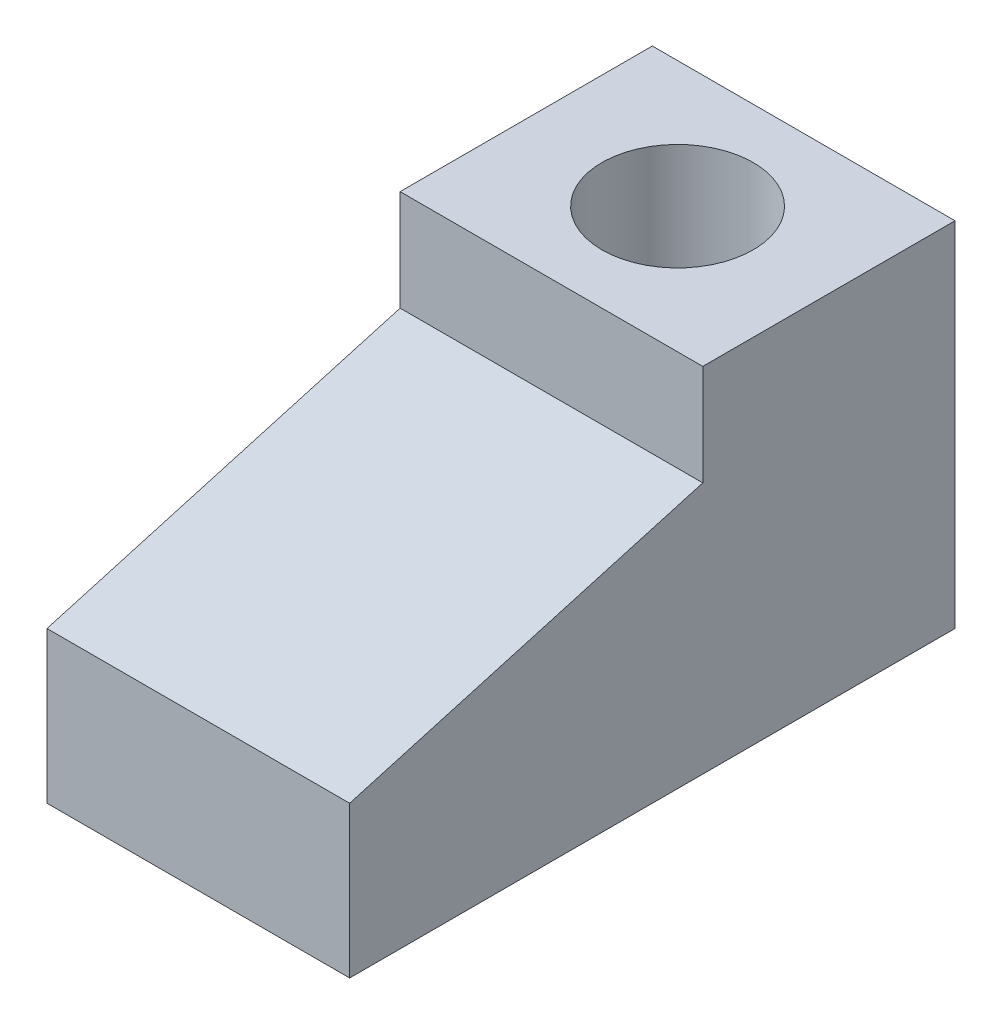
ISO-10303-21;
HEADER;
FILE_DESCRIPTION(('STEP AP214'),'2;1');
FILE_NAME('part.step','',(''),(''),'','','');
FILE_SCHEMA(('AUTOMOTIVE_DESIGN { 1 0 10303 214 1 1 1 1 }'));
ENDSEC;
DATA;
#1=APPLICATION_CONTEXT('core data for automotive mechanical design processes');
#2=APPLICATION_PROTOCOL_DEFINITION('international standard','automotive_design',2000,#1);
#3=PRODUCT_CONTEXT('',#1,'mechanical');
#4=PRODUCT('Part','Part','',(#3));
#5=PRODUCT_RELATED_PRODUCT_CATEGORY('part','',(#4));
#6=PRODUCT_DEFINITION_FORMATION('','',#4);
#7=PRODUCT_DEFINITION_CONTEXT('part definition',#1,'design');
#8=PRODUCT_DEFINITION('design','',#6,#7);
#9=PRODUCT_DEFINITION_SHAPE('','',#8);
#10=(LENGTH_UNIT() NAMED_UNIT(*) SI_UNIT(.MILLI.,.METRE.));
#11=(NAMED_UNIT(*) PLANE_ANGLE_UNIT() SI_UNIT($,.RADIAN.));
#12=(NAMED_UNIT(*) SI_UNIT($,.STERADIAN.) SOLID_ANGLE_UNIT());
#13=UNCERTAINTY_MEASURE_WITH_UNIT(LENGTH_MEASURE(1.E-05),#10,'distance_accuracy_value','');
#14=(GEOMETRIC_REPRESENTATION_CONTEXT(3) GLOBAL_UNCERTAINTY_ASSIGNED_CONTEXT((#13)) GLOBAL_UNIT_ASSIGNED_CONTEXT((#10,
#11,#12)) REPRESENTATION_CONTEXT('',''));
#15=CARTESIAN_POINT('',(0.,0.,0.));
#16=DIRECTION('',(0.,0.,1.));
#17=DIRECTION('',(1.,0.,0.));
#18=AXIS2_PLACEMENT_3D('',#15,#16,#17);
#19=CARTESIAN_POINT('',(10.,6.,2.));
#20=DIRECTION('',(0.,0.,-1.));
#21=DIRECTION('',(0.,1.,0.));
#22=AXIS2_PLACEMENT_3D('',#19,#20,#21);
#23=PLANE('',#22);
#24=DIRECTION('',(0.,-1.,0.));
#25=VECTOR('',#24,1.);
#26=CARTESIAN_POINT('',(4.,6.,2.));
#27=LINE('',#26,#25);
#28=CARTESIAN_POINT('',(4.,6.,2.));
#29=VERTEX_POINT('',#28);
#30=CARTESIAN_POINT('',(4.,3.,2.));
#31=VERTEX_POINT('',#30);
#32=EDGE_CURVE('E86',#29,#31,#27,.T.);
#33=ORIENTED_EDGE('',*,*,#32,.T.);
#34=DIRECTION('',(-1.,0.,0.));
#35=VECTOR('',#34,1.);
#36=CARTESIAN_POINT('',(10.,3.,2.));
#37=LINE('',#36,#35);
#38=CARTESIAN_POINT('',(10.,3.,2.));
#39=VERTEX_POINT('',#38);
#40=EDGE_CURVE('E11',#39,#31,#37,.T.);
#41=ORIENTED_EDGE('',*,*,#40,.F.);
#42=DIRECTION('',(0.,-1.,0.));
#43=VECTOR('',#42,1.);
#44=CARTESIAN_POINT('',(10.,6.,2.));
#45=LINE('',#44,#43);
#46=CARTESIAN_POINT('',(10.,6.,2.));
#47=VERTEX_POINT('',#46);
#48=EDGE_CURVE('E114',#47,#39,#45,.T.);
#49=ORIENTED_EDGE('',*,*,#48,.F.);
#50=DIRECTION('',(-1.,0.,0.));
#51=VECTOR('',#50,1.);
#52=CARTESIAN_POINT('',(10.,6.,2.));
#53=LINE('',#52,#51);
#54=EDGE_CURVE('E99',#47,#29,#53,.T.);
#55=ORIENTED_EDGE('',*,*,#54,.T.);
#56=EDGE_LOOP('',(#33,#41,#49,#55));
#57=FACE_BOUND('',#56,.T.);
#58=ADVANCED_FACE('F30',(#57),#23,.F.);
#59=CARTESIAN_POINT('',(10.,3.,2.));
#60=DIRECTION('',(0.,1.,0.));
#61=DIRECTION('',(0.,0.,1.));
#62=AXIS2_PLACEMENT_3D('',#59,#60,#61);
#63=PLANE('',#62);
#64=CARTESIAN_POINT('',(7.,3.,-7.50000000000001));
#65=DIRECTION('',(0.,1.,0.));
#66=DIRECTION('',(0.,0.,1.));
#67=AXIS2_PLACEMENT_3D('',#64,#65,#66);
#68=CIRCLE('',#67,1.5);
#69=CARTESIAN_POINT('',(7.,3.,-6.00000000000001));
#70=VERTEX_POINT('',#69);
#71=EDGE_CURVE('E100',#70,#70,#68,.T.);
#72=ORIENTED_EDGE('',*,*,#71,.T.);
#73=EDGE_LOOP('',(#72));
#74=FACE_BOUND('',#73,.T.);
#75=DIRECTION('',(0.,0.,-1.));
#76=VECTOR('',#75,1.);
#77=CARTESIAN_POINT('',(4.,3.,2.));
#78=LINE('',#77,#76);
#79=CARTESIAN_POINT('',(4.,3.,-10.));
#80=VERTEX_POINT('',#79);
#81=EDGE_CURVE('E82',#31,#80,#78,.T.);
#82=ORIENTED_EDGE('',*,*,#81,.T.);
#83=DIRECTION('',(-1.,0.,0.));
#84=VECTOR('',#83,1.);
#85=CARTESIAN_POINT('',(10.,3.,-10.));
#86=LINE('',#85,#84);
#87=CARTESIAN_POINT('',(10.,3.,-10.));
#88=VERTEX_POINT('',#87);
#89=EDGE_CURVE('E37',#88,#80,#86,.T.);
#90=ORIENTED_EDGE('',*,*,#89,.F.);
#91=DIRECTION('',(0.,0.,-1.));
#92=VECTOR('',#91,1.);
#93=CARTESIAN_POINT('',(10.,3.,2.));
#94=LINE('',#93,#92);
#95=EDGE_CURVE('E95',#39,#88,#94,.T.);
#96=ORIENTED_EDGE('',*,*,#95,.F.);
#97=ORIENTED_EDGE('',*,*,#40,.T.);
#98=EDGE_LOOP('',(#82,#90,#96,#97));
#99=FACE_BOUND('',#98,.T.);
#100=ADVANCED_FACE('F94',(#74,#99),#63,.F.);
#101=CARTESIAN_POINT('',(10.,3.,-10.));
#102=DIRECTION('',(0.,0.,1.));
#103=DIRECTION('',(0.,-1.,0.));
#104=AXIS2_PLACEMENT_3D('',#101,#102,#103);
#105=PLANE('',#104);
#106=DIRECTION('',(0.,1.,0.));
#107=VECTOR('',#106,1.);
#108=CARTESIAN_POINT('',(4.,3.,-10.));
#109=LINE('',#108,#107);
#110=CARTESIAN_POINT('',(4.,10.,-10.));
#111=VERTEX_POINT('',#110);
#112=EDGE_CURVE('E88',#80,#111,#109,.T.);
#113=ORIENTED_EDGE('',*,*,#112,.T.);
#114=DIRECTION('',(-1.,0.,0.));
#115=VECTOR('',#114,1.);
#116=CARTESIAN_POINT('',(10.,10.,-10.));
#117=LINE('',#116,#115);
#118=CARTESIAN_POINT('',(10.,10.,-10.));
#119=VERTEX_POINT('',#118);
#120=EDGE_CURVE('E130',#119,#111,#117,.T.);
#121=ORIENTED_EDGE('',*,*,#120,.F.);
#122=DIRECTION('',(0.,1.,0.));
#123=VECTOR('',#122,1.);
#124=CARTESIAN_POINT('',(10.,3.,-10.));
#125=LINE('',#124,#123);
#126=EDGE_CURVE('E117',#88,#119,#125,.T.);
#127=ORIENTED_EDGE('',*,*,#126,.F.);
#128=ORIENTED_EDGE('',*,*,#89,.T.);
#129=EDGE_LOOP('',(#113,#121,#127,#128));
#130=FACE_BOUND('',#129,.T.);
#131=ADVANCED_FACE('F134',(#130),#105,.F.);
#132=CARTESIAN_POINT('',(10.,10.,-10.));
#133=DIRECTION('',(0.,-1.,0.));
#134=DIRECTION('',(0.,0.,-1.));
#135=AXIS2_PLACEMENT_3D('',#132,#133,#134);
#136=PLANE('',#135);
#137=CARTESIAN_POINT('',(7.,10.,-7.5));
#138=DIRECTION('',(0.,1.,0.));
#139=DIRECTION('',(0.,0.,1.));
#140=AXIS2_PLACEMENT_3D('',#137,#138,#139);
#141=CIRCLE('',#140,1.5);
#142=CARTESIAN_POINT('',(7.,10.,-6.));
#143=VERTEX_POINT('',#142);
#144=EDGE_CURVE('E103',#143,#143,#141,.T.);
#145=ORIENTED_EDGE('',*,*,#144,.F.);
#146=EDGE_LOOP('',(#145));
#147=FACE_BOUND('',#146,.T.);
#148=DIRECTION('',(0.,0.,1.));
#149=VECTOR('',#148,1.);
#150=CARTESIAN_POINT('',(4.,10.,-10.));
#151=LINE('',#150,#149);
#152=CARTESIAN_POINT('',(4.,10.,-5.));
#153=VERTEX_POINT('',#152);
#154=EDGE_CURVE('E108',#111,#153,#151,.T.);
#155=ORIENTED_EDGE('',*,*,#154,.T.);
#156=DIRECTION('',(-1.,0.,0.));
#157=VECTOR('',#156,1.);
#158=CARTESIAN_POINT('',(10.,10.,-5.));
#159=LINE('',#158,#157);
#160=CARTESIAN_POINT('',(10.,10.,-5.));
#161=VERTEX_POINT('',#160);
#162=EDGE_CURVE('E127',#161,#153,#159,.T.);
#163=ORIENTED_EDGE('',*,*,#162,.F.);
#164=DIRECTION('',(0.,0.,1.));
#165=VECTOR('',#164,1.);
#166=CARTESIAN_POINT('',(10.,10.,-10.));
#167=LINE('',#166,#165);
#168=EDGE_CURVE('E119',#119,#161,#167,.T.);
#169=ORIENTED_EDGE('',*,*,#168,.F.);
#170=ORIENTED_EDGE('',*,*,#120,.T.);
#171=EDGE_LOOP('',(#155,#163,#169,#170));
#172=FACE_BOUND('',#171,.T.);
#173=ADVANCED_FACE('F140',(#147,#172),#136,.F.);
#174=CARTESIAN_POINT('',(10.,10.,-5.));
#175=DIRECTION('',(0.,0.,-1.));
#176=DIRECTION('',(0.,1.,0.));
#177=AXIS2_PLACEMENT_3D('',#174,#175,#176);
#178=PLANE('',#177);
#179=DIRECTION('',(0.,-1.,0.));
#180=VECTOR('',#179,1.);
#181=CARTESIAN_POINT('',(4.,10.,-5.));
#182=LINE('',#181,#180);
#183=CARTESIAN_POINT('',(4.,8.,-5.));
#184=VERTEX_POINT('',#183);
#185=EDGE_CURVE('E110',#153,#184,#182,.T.);
#186=ORIENTED_EDGE('',*,*,#185,.T.);
#187=DIRECTION('',(-1.,0.,0.));
#188=VECTOR('',#187,1.);
#189=CARTESIAN_POINT('',(10.,8.,-5.));
#190=LINE('',#189,#188);
#191=CARTESIAN_POINT('',(10.,8.,-5.));
#192=VERTEX_POINT('',#191);
#193=EDGE_CURVE('E124',#192,#184,#190,.T.);
#194=ORIENTED_EDGE('',*,*,#193,.F.);
#195=DIRECTION('',(0.,-1.,0.));
#196=VECTOR('',#195,1.);
#197=CARTESIAN_POINT('',(10.,10.,-5.));
#198=LINE('',#197,#196);
#199=EDGE_CURVE('E49',#161,#192,#198,.T.);
#200=ORIENTED_EDGE('',*,*,#199,.F.);
#201=ORIENTED_EDGE('',*,*,#162,.T.);
#202=EDGE_LOOP('',(#186,#194,#200,#201));
#203=FACE_BOUND('',#202,.T.);
#204=ADVANCED_FACE('F143',(#203),#178,.F.);
#205=CARTESIAN_POINT('',(10.,8.,-5.));
#206=DIRECTION('',(0.,-0.961523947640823,-0.274721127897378));
#207=DIRECTION('',(0.,0.274721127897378,-0.961523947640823));
#208=AXIS2_PLACEMENT_3D('',#205,#206,#207);
#209=PLANE('',#208);
#210=DIRECTION('',(0.,-0.274721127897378,0.961523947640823));
#211=VECTOR('',#210,1.);
#212=CARTESIAN_POINT('',(4.,8.,-5.));
#213=LINE('',#212,#211);
#214=EDGE_CURVE('E112',#184,#29,#213,.T.);
#215=ORIENTED_EDGE('',*,*,#214,.T.);
#216=ORIENTED_EDGE('',*,*,#54,.F.);
#217=DIRECTION('',(0.,-0.274721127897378,0.961523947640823));
#218=VECTOR('',#217,1.);
#219=CARTESIAN_POINT('',(10.,8.,-5.));
#220=LINE('',#219,#218);
#221=EDGE_CURVE('E44',#192,#47,#220,.T.);
#222=ORIENTED_EDGE('',*,*,#221,.F.);
#223=ORIENTED_EDGE('',*,*,#193,.T.);
#224=EDGE_LOOP('',(#215,#216,#222,#223));
#225=FACE_BOUND('',#224,.T.);
#226=ADVANCED_FACE('F145',(#225),#209,.F.);
#227=CARTESIAN_POINT('',(10.,3.,2.));
#228=DIRECTION('',(1.,0.,0.));
#229=DIRECTION('',(0.,0.,-1.));
#230=AXIS2_PLACEMENT_3D('',#227,#228,#229);
#231=PLANE('',#230);
#232=ORIENTED_EDGE('',*,*,#48,.T.);
#233=ORIENTED_EDGE('',*,*,#95,.T.);
#234=ORIENTED_EDGE('',*,*,#126,.T.);
#235=ORIENTED_EDGE('',*,*,#168,.T.);
#236=ORIENTED_EDGE('',*,*,#199,.T.);
#237=ORIENTED_EDGE('',*,*,#221,.T.);
#238=EDGE_LOOP('',(#232,#233,#234,#235,#236,#237));
#239=FACE_BOUND('',#238,.T.);
#240=ADVANCED_FACE('F137',(#239),#231,.T.);
#241=CARTESIAN_POINT('',(4.,3.,2.));
#242=DIRECTION('',(1.,0.,0.));
#243=DIRECTION('',(0.,0.,-1.));
#244=AXIS2_PLACEMENT_3D('',#241,#242,#243);
#245=PLANE('',#244);
#246=ORIENTED_EDGE('',*,*,#32,.F.);
#247=ORIENTED_EDGE('',*,*,#214,.F.);
#248=ORIENTED_EDGE('',*,*,#185,.F.);
#249=ORIENTED_EDGE('',*,*,#154,.F.);
#250=ORIENTED_EDGE('',*,*,#112,.F.);
#251=ORIENTED_EDGE('',*,*,#81,.F.);
#252=EDGE_LOOP('',(#246,#247,#248,#249,#250,#251));
#253=FACE_BOUND('',#252,.T.);
#254=ADVANCED_FACE('F83',(#253),#245,.F.);
#255=CARTESIAN_POINT('',(7.,3.,-7.50000000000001));
#256=DIRECTION('',(0.,1.,0.));
#257=DIRECTION('',(0.,0.,1.));
#258=AXIS2_PLACEMENT_3D('',#255,#256,#257);
#259=CYLINDRICAL_SURFACE('',#258,1.5);
#260=ORIENTED_EDGE('',*,*,#71,.F.);
#261=EDGE_LOOP('',(#260));
#262=FACE_BOUND('',#261,.T.);
#263=ORIENTED_EDGE('',*,*,#144,.T.);
#264=EDGE_LOOP('',(#263));
#265=FACE_BOUND('',#264,.T.);
#266=ADVANCED_FACE('F171',(#262,#265),#259,.F.);
#267=CLOSED_SHELL('',(#58,#100,#131,#173,#204,#226,#240,#254,#266));
#268=MANIFOLD_SOLID_BREP('B2',#267);
#269=ADVANCED_BREP_SHAPE_REPRESENTATION('',(#18,#268),#14);
#270=SHAPE_DEFINITION_REPRESENTATION(#9,#269);
ENDSEC;
END-ISO-10303-21;
